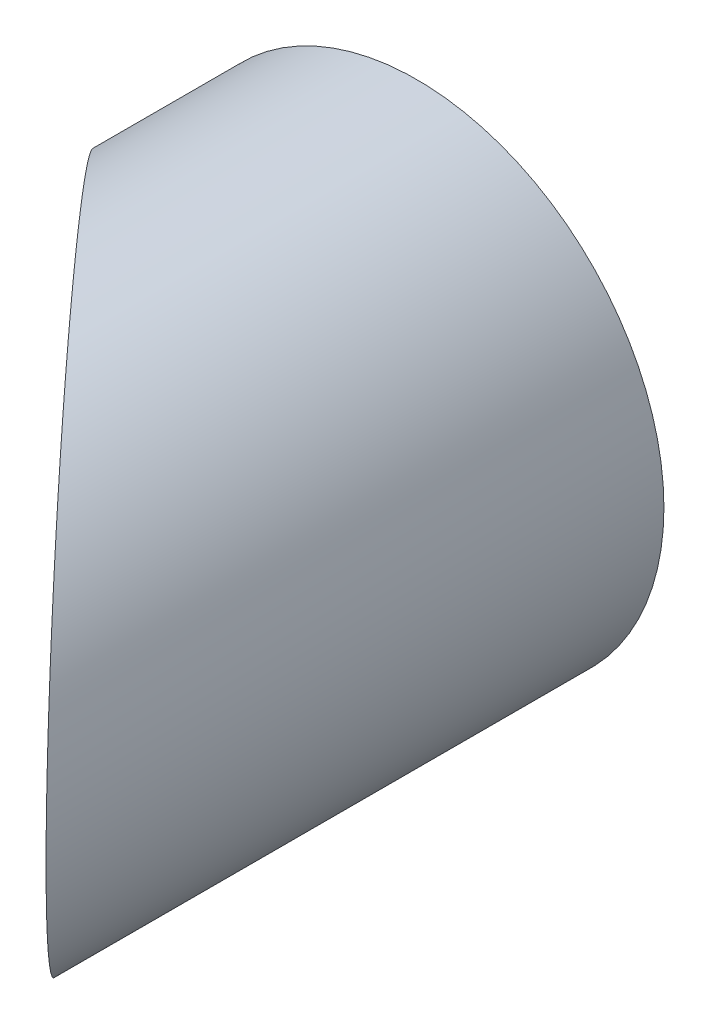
from build123d import *

# Parameters (mm, degrees)
SKETCH1_R               = 9.525
SKETCH1_R_2             = 3.9878
BOSS_EXTRUDE1_DEPTH     = 23.8125
CUT_EXTRUDE1_DEPTH      = 28.358479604
CUT_EXTRUDE1_DEPTH_BACK = 28.358479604


with BuildPart() as part:
    # Sketch1 → Boss-Extrude1 (new body)
    with BuildSketch(Plane.XY):
        Circle(SKETCH1_R)
        Circle(SKETCH1_R_2, mode=Mode.SUBTRACT)
    extrude(amount=BOSS_EXTRUDE1_DEPTH)

    # Sketch2 → Cut-Extrude1 (cut, two sides: drawn at the far end of the back side and taken through both)
    with BuildSketch(Plane(origin=(0, 0, 0), x_dir=(1, 0, 0), z_dir=(0, 1, 0)).offset(-CUT_EXTRUDE1_DEPTH_BACK)):
        Polygon((9.525, -23.8125), (-13.901390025, 2.205141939), (-13.901390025, -23.8125), align=None)
    extrude(amount=CUT_EXTRUDE1_DEPTH + CUT_EXTRUDE1_DEPTH_BACK, mode=Mode.SUBTRACT)


solid = part.part
